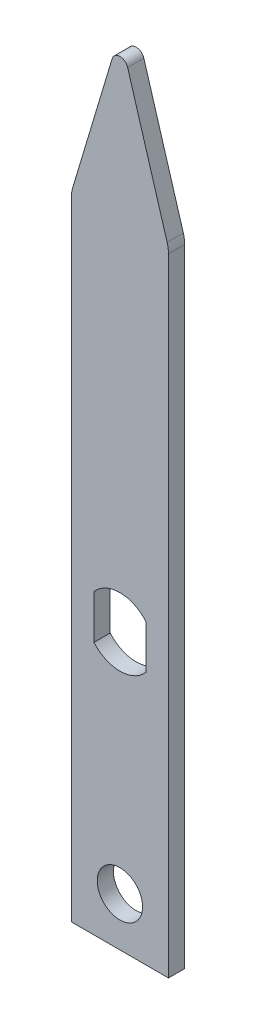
ISO-10303-21;
HEADER;
FILE_DESCRIPTION(('STEP AP214'),'2;1');
FILE_NAME('part.step','',(''),(''),'','','');
FILE_SCHEMA(('AUTOMOTIVE_DESIGN { 1 0 10303 214 1 1 1 1 }'));
ENDSEC;
DATA;
#1=APPLICATION_CONTEXT('core data for automotive mechanical design processes');
#2=APPLICATION_PROTOCOL_DEFINITION('international standard','automotive_design',2000,#1);
#3=PRODUCT_CONTEXT('',#1,'mechanical');
#4=PRODUCT('Part','Part','',(#3));
#5=PRODUCT_RELATED_PRODUCT_CATEGORY('part','',(#4));
#6=PRODUCT_DEFINITION_FORMATION('','',#4);
#7=PRODUCT_DEFINITION_CONTEXT('part definition',#1,'design');
#8=PRODUCT_DEFINITION('design','',#6,#7);
#9=PRODUCT_DEFINITION_SHAPE('','',#8);
#10=(LENGTH_UNIT() NAMED_UNIT(*) SI_UNIT(.MILLI.,.METRE.));
#11=(NAMED_UNIT(*) PLANE_ANGLE_UNIT() SI_UNIT($,.RADIAN.));
#12=(NAMED_UNIT(*) SI_UNIT($,.STERADIAN.) SOLID_ANGLE_UNIT());
#13=UNCERTAINTY_MEASURE_WITH_UNIT(LENGTH_MEASURE(1.E-05),#10,'distance_accuracy_value','');
#14=(GEOMETRIC_REPRESENTATION_CONTEXT(3) GLOBAL_UNCERTAINTY_ASSIGNED_CONTEXT((#13)) GLOBAL_UNIT_ASSIGNED_CONTEXT((#10,
#11,#12)) REPRESENTATION_CONTEXT('',''));
#15=CARTESIAN_POINT('',(0.,0.,0.));
#16=DIRECTION('',(0.,0.,1.));
#17=DIRECTION('',(1.,0.,0.));
#18=AXIS2_PLACEMENT_3D('',#15,#16,#17);
#19=CARTESIAN_POINT('',(15.,0.,5.));
#20=DIRECTION('',(0.,1.,0.));
#21=DIRECTION('',(-1.,0.,0.));
#22=AXIS2_PLACEMENT_3D('',#19,#20,#21);
#23=PLANE('',#22);
#24=DIRECTION('',(1.,0.,0.));
#25=VECTOR('',#24,1.);
#26=CARTESIAN_POINT('',(15.,0.,0.));
#27=LINE('',#26,#25);
#28=CARTESIAN_POINT('',(-15.,0.,0.));
#29=VERTEX_POINT('',#28);
#30=CARTESIAN_POINT('',(15.,0.,0.));
#31=VERTEX_POINT('',#30);
#32=EDGE_CURVE('E167',#29,#31,#27,.T.);
#33=ORIENTED_EDGE('',*,*,#32,.T.);
#34=DIRECTION('',(0.,0.,-1.));
#35=VECTOR('',#34,1.);
#36=CARTESIAN_POINT('',(15.,0.,5.));
#37=LINE('',#36,#35);
#38=CARTESIAN_POINT('',(15.,0.,5.));
#39=VERTEX_POINT('',#38);
#40=EDGE_CURVE('E196',#39,#31,#37,.T.);
#41=ORIENTED_EDGE('',*,*,#40,.F.);
#42=DIRECTION('',(1.,0.,0.));
#43=VECTOR('',#42,1.);
#44=CARTESIAN_POINT('',(15.,0.,5.));
#45=LINE('',#44,#43);
#46=CARTESIAN_POINT('',(-15.,0.,5.));
#47=VERTEX_POINT('',#46);
#48=EDGE_CURVE('E170',#47,#39,#45,.T.);
#49=ORIENTED_EDGE('',*,*,#48,.F.);
#50=DIRECTION('',(0.,0.,-1.));
#51=VECTOR('',#50,1.);
#52=CARTESIAN_POINT('',(-15.,0.,5.));
#53=LINE('',#52,#51);
#54=EDGE_CURVE('E183',#47,#29,#53,.T.);
#55=ORIENTED_EDGE('',*,*,#54,.T.);
#56=EDGE_LOOP('',(#33,#41,#49,#55));
#57=FACE_BOUND('',#56,.T.);
#58=ADVANCED_FACE('F32',(#57),#23,.F.);
#59=CARTESIAN_POINT('',(15.,195.,5.));
#60=DIRECTION('',(-1.,0.,0.));
#61=DIRECTION('',(0.,-1.,0.));
#62=AXIS2_PLACEMENT_3D('',#59,#60,#61);
#63=PLANE('',#62);
#64=DIRECTION('',(0.,1.,0.));
#65=VECTOR('',#64,1.);
#66=CARTESIAN_POINT('',(15.,195.,0.));
#67=LINE('',#66,#65);
#68=CARTESIAN_POINT('',(15.,193.532311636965,0.));
#69=VERTEX_POINT('',#68);
#70=EDGE_CURVE('E186',#31,#69,#67,.T.);
#71=ORIENTED_EDGE('',*,*,#70,.T.);
#72=DIRECTION('',(0.,0.,-1.));
#73=VECTOR('',#72,1.);
#74=CARTESIAN_POINT('',(15.,193.532311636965,5.));
#75=LINE('',#74,#73);
#76=CARTESIAN_POINT('',(15.,193.532311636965,5.));
#77=VERTEX_POINT('',#76);
#78=EDGE_CURVE('E217',#69,#77,#75,.F.);
#79=ORIENTED_EDGE('',*,*,#78,.T.);
#80=DIRECTION('',(0.,1.,0.));
#81=VECTOR('',#80,1.);
#82=CARTESIAN_POINT('',(15.,195.,5.));
#83=LINE('',#82,#81);
#84=EDGE_CURVE('E173',#39,#77,#83,.T.);
#85=ORIENTED_EDGE('',*,*,#84,.F.);
#86=ORIENTED_EDGE('',*,*,#40,.T.);
#87=EDGE_LOOP('',(#71,#79,#85,#86));
#88=FACE_BOUND('',#87,.T.);
#89=ADVANCED_FACE('F256',(#88),#63,.F.);
#90=CARTESIAN_POINT('',(0.,245.,5.));
#91=DIRECTION('',(-0.957826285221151,-0.287347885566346,0.));
#92=DIRECTION('',(0.287347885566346,-0.957826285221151,0.));
#93=AXIS2_PLACEMENT_3D('',#90,#91,#92);
#94=PLANE('',#93);
#95=DIRECTION('',(-0.287347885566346,0.957826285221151,0.));
#96=VECTOR('',#95,1.);
#97=CARTESIAN_POINT('',(0.,245.,5.));
#98=LINE('',#97,#96);
#99=CARTESIAN_POINT('',(14.5782628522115,196.405790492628,5.));
#100=VERTEX_POINT('',#99);
#101=CARTESIAN_POINT('',(2.39456571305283,237.018114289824,5.));
#102=VERTEX_POINT('',#101);
#103=EDGE_CURVE('E177',#100,#102,#98,.T.);
#104=ORIENTED_EDGE('',*,*,#103,.F.);
#105=DIRECTION('',(0.,0.,-1.));
#106=VECTOR('',#105,1.);
#107=CARTESIAN_POINT('',(14.5782628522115,196.405790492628,5.));
#108=LINE('',#107,#106);
#109=CARTESIAN_POINT('',(14.5782628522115,196.405790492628,0.));
#110=VERTEX_POINT('',#109);
#111=EDGE_CURVE('E210',#100,#110,#108,.T.);
#112=ORIENTED_EDGE('',*,*,#111,.T.);
#113=DIRECTION('',(-0.287347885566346,0.957826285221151,0.));
#114=VECTOR('',#113,1.);
#115=CARTESIAN_POINT('',(0.,245.,0.));
#116=LINE('',#115,#114);
#117=CARTESIAN_POINT('',(2.39456571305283,237.018114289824,0.));
#118=VERTEX_POINT('',#117);
#119=EDGE_CURVE('E189',#110,#118,#116,.T.);
#120=ORIENTED_EDGE('',*,*,#119,.T.);
#121=DIRECTION('',(0.,0.,-1.));
#122=VECTOR('',#121,1.);
#123=CARTESIAN_POINT('',(2.39456571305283,237.018114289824,5.));
#124=LINE('',#123,#122);
#125=EDGE_CURVE('E205',#118,#102,#124,.F.);
#126=ORIENTED_EDGE('',*,*,#125,.T.);
#127=EDGE_LOOP('',(#104,#112,#120,#126));
#128=FACE_BOUND('',#127,.T.);
#129=ADVANCED_FACE('F244',(#128),#94,.F.);
#130=CARTESIAN_POINT('',(-15.0000000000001,195.,5.));
#131=DIRECTION('',(0.957826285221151,-0.287347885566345,0.));
#132=DIRECTION('',(0.287347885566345,0.957826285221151,0.));
#133=AXIS2_PLACEMENT_3D('',#130,#131,#132);
#134=PLANE('',#133);
#135=DIRECTION('',(-0.287347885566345,-0.957826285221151,0.));
#136=VECTOR('',#135,1.);
#137=CARTESIAN_POINT('',(-15.0000000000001,195.,0.));
#138=LINE('',#137,#136);
#139=CARTESIAN_POINT('',(-2.39456571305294,237.018114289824,0.));
#140=VERTEX_POINT('',#139);
#141=CARTESIAN_POINT('',(-14.5782628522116,196.405790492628,0.));
#142=VERTEX_POINT('',#141);
#143=EDGE_CURVE('E191',#140,#142,#138,.T.);
#144=ORIENTED_EDGE('',*,*,#143,.T.);
#145=DIRECTION('',(0.,0.,-1.));
#146=VECTOR('',#145,1.);
#147=CARTESIAN_POINT('',(-14.5782628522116,196.405790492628,5.));
#148=LINE('',#147,#146);
#149=CARTESIAN_POINT('',(-14.5782628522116,196.405790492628,5.));
#150=VERTEX_POINT('',#149);
#151=EDGE_CURVE('E11',#142,#150,#148,.F.);
#152=ORIENTED_EDGE('',*,*,#151,.T.);
#153=DIRECTION('',(-0.287347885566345,-0.957826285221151,0.));
#154=VECTOR('',#153,1.);
#155=CARTESIAN_POINT('',(-15.0000000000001,195.,5.));
#156=LINE('',#155,#154);
#157=CARTESIAN_POINT('',(-2.39456571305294,237.018114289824,5.));
#158=VERTEX_POINT('',#157);
#159=EDGE_CURVE('E179',#158,#150,#156,.T.);
#160=ORIENTED_EDGE('',*,*,#159,.F.);
#161=DIRECTION('',(0.,0.,-1.));
#162=VECTOR('',#161,1.);
#163=CARTESIAN_POINT('',(-2.39456571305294,237.018114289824,5.));
#164=LINE('',#163,#162);
#165=EDGE_CURVE('E199',#158,#140,#164,.T.);
#166=ORIENTED_EDGE('',*,*,#165,.T.);
#167=EDGE_LOOP('',(#144,#152,#160,#166));
#168=FACE_BOUND('',#167,.T.);
#169=ADVANCED_FACE('F250',(#168),#134,.F.);
#170=CARTESIAN_POINT('',(-15.,0.,5.));
#171=DIRECTION('',(1.,0.,0.));
#172=DIRECTION('',(0.,1.,0.));
#173=AXIS2_PLACEMENT_3D('',#170,#171,#172);
#174=PLANE('',#173);
#175=DIRECTION('',(0.,-1.,0.));
#176=VECTOR('',#175,1.);
#177=CARTESIAN_POINT('',(-15.,0.,5.));
#178=LINE('',#177,#176);
#179=CARTESIAN_POINT('',(-15.0000000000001,193.532311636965,5.));
#180=VERTEX_POINT('',#179);
#181=EDGE_CURVE('E181',#180,#47,#178,.T.);
#182=ORIENTED_EDGE('',*,*,#181,.F.);
#183=DIRECTION('',(0.,0.,-1.));
#184=VECTOR('',#183,1.);
#185=CARTESIAN_POINT('',(-15.0000000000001,193.532311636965,5.));
#186=LINE('',#185,#184);
#187=CARTESIAN_POINT('',(-15.0000000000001,193.532311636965,0.));
#188=VERTEX_POINT('',#187);
#189=EDGE_CURVE('E40',#180,#188,#186,.T.);
#190=ORIENTED_EDGE('',*,*,#189,.T.);
#191=DIRECTION('',(0.,-1.,0.));
#192=VECTOR('',#191,1.);
#193=CARTESIAN_POINT('',(-15.,0.,0.));
#194=LINE('',#193,#192);
#195=EDGE_CURVE('E174',#188,#29,#194,.T.);
#196=ORIENTED_EDGE('',*,*,#195,.T.);
#197=ORIENTED_EDGE('',*,*,#54,.F.);
#198=EDGE_LOOP('',(#182,#190,#196,#197));
#199=FACE_BOUND('',#198,.T.);
#200=ADVANCED_FACE('F225',(#199),#174,.F.);
#201=CARTESIAN_POINT('',(-15.,0.,5.));
#202=DIRECTION('',(0.,0.,-1.));
#203=DIRECTION('',(-1.,0.,0.));
#204=AXIS2_PLACEMENT_3D('',#201,#202,#203);
#205=PLANE('',#204);
#206=DIRECTION('',(0.,1.,0.));
#207=VECTOR('',#206,1.);
#208=CARTESIAN_POINT('',(8.,91.8007352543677,5.));
#209=LINE('',#208,#207);
#210=CARTESIAN_POINT('',(8.,78.1992647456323,5.));
#211=VERTEX_POINT('',#210);
#212=CARTESIAN_POINT('',(8.,91.8007352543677,5.));
#213=VERTEX_POINT('',#212);
#214=EDGE_CURVE('E148',#211,#213,#209,.T.);
#215=ORIENTED_EDGE('',*,*,#214,.F.);
#216=CARTESIAN_POINT('',(0.,85.,5.));
#217=DIRECTION('',(0.,0.,1.));
#218=DIRECTION('',(1.,0.,0.));
#219=AXIS2_PLACEMENT_3D('',#216,#217,#218);
#220=CIRCLE('',#219,10.5);
#221=CARTESIAN_POINT('',(-8.,78.1992647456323,5.));
#222=VERTEX_POINT('',#221);
#223=EDGE_CURVE('E140',#222,#211,#220,.T.);
#224=ORIENTED_EDGE('',*,*,#223,.F.);
#225=DIRECTION('',(0.,-1.,0.));
#226=VECTOR('',#225,1.);
#227=CARTESIAN_POINT('',(-8.,91.8007352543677,5.));
#228=LINE('',#227,#226);
#229=CARTESIAN_POINT('',(-8.,91.8007352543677,5.));
#230=VERTEX_POINT('',#229);
#231=EDGE_CURVE('E141',#230,#222,#228,.T.);
#232=ORIENTED_EDGE('',*,*,#231,.F.);
#233=CARTESIAN_POINT('',(0.,85.,5.));
#234=DIRECTION('',(0.,0.,1.));
#235=DIRECTION('',(1.,0.,0.));
#236=AXIS2_PLACEMENT_3D('',#233,#234,#235);
#237=CIRCLE('',#236,10.5);
#238=EDGE_CURVE('E155',#213,#230,#237,.T.);
#239=ORIENTED_EDGE('',*,*,#238,.F.);
#240=EDGE_LOOP('',(#215,#224,#232,#239));
#241=FACE_BOUND('',#240,.T.);
#242=CARTESIAN_POINT('',(0.,15.,5.));
#243=DIRECTION('',(0.,0.,1.));
#244=DIRECTION('',(1.,0.,0.));
#245=AXIS2_PLACEMENT_3D('',#242,#243,#244);
#246=CIRCLE('',#245,7.);
#247=CARTESIAN_POINT('',(7.,15.,5.));
#248=VERTEX_POINT('',#247);
#249=EDGE_CURVE('E164',#248,#248,#246,.T.);
#250=ORIENTED_EDGE('',*,*,#249,.F.);
#251=EDGE_LOOP('',(#250));
#252=FACE_BOUND('',#251,.T.);
#253=ORIENTED_EDGE('',*,*,#84,.T.);
#254=CARTESIAN_POINT('',(4.99999999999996,193.532311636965,5.));
#255=DIRECTION('',(0.,0.,-1.));
#256=DIRECTION('',(-1.,0.,0.));
#257=AXIS2_PLACEMENT_3D('',#254,#255,#256);
#258=CIRCLE('',#257,10.);
#259=EDGE_CURVE('E220',#77,#100,#258,.F.);
#260=ORIENTED_EDGE('',*,*,#259,.T.);
#261=ORIENTED_EDGE('',*,*,#103,.T.);
#262=CARTESIAN_POINT('',(0.,236.299744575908,5.));
#263=DIRECTION('',(0.,0.,-1.));
#264=DIRECTION('',(-1.,0.,0.));
#265=AXIS2_PLACEMENT_3D('',#262,#263,#264);
#266=CIRCLE('',#265,2.5);
#267=EDGE_CURVE('E208',#102,#158,#266,.F.);
#268=ORIENTED_EDGE('',*,*,#267,.T.);
#269=ORIENTED_EDGE('',*,*,#159,.T.);
#270=CARTESIAN_POINT('',(-5.00000000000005,193.532311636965,5.));
#271=DIRECTION('',(0.,0.,-1.));
#272=DIRECTION('',(-1.,0.,0.));
#273=AXIS2_PLACEMENT_3D('',#270,#271,#272);
#274=CIRCLE('',#273,10.);
#275=EDGE_CURVE('E47',#150,#180,#274,.F.);
#276=ORIENTED_EDGE('',*,*,#275,.T.);
#277=ORIENTED_EDGE('',*,*,#181,.T.);
#278=ORIENTED_EDGE('',*,*,#48,.T.);
#279=EDGE_LOOP('',(#253,#260,#261,#268,#269,#276,#277,#278));
#280=FACE_BOUND('',#279,.T.);
#281=ADVANCED_FACE('F235',(#241,#252,#280),#205,.F.);
#282=CARTESIAN_POINT('',(-15.,0.,0.));
#283=DIRECTION('',(0.,0.,-1.));
#284=DIRECTION('',(-1.,0.,0.));
#285=AXIS2_PLACEMENT_3D('',#282,#283,#284);
#286=PLANE('',#285);
#287=CARTESIAN_POINT('',(0.,85.,0.));
#288=DIRECTION('',(0.,0.,-1.));
#289=DIRECTION('',(-1.,0.,0.));
#290=AXIS2_PLACEMENT_3D('',#287,#288,#289);
#291=CIRCLE('',#290,10.5);
#292=CARTESIAN_POINT('',(-8.,78.1992647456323,0.));
#293=VERTEX_POINT('',#292);
#294=CARTESIAN_POINT('',(8.,78.1992647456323,0.));
#295=VERTEX_POINT('',#294);
#296=EDGE_CURVE('E137',#293,#295,#291,.F.);
#297=ORIENTED_EDGE('',*,*,#296,.T.);
#298=DIRECTION('',(0.,1.,0.));
#299=VECTOR('',#298,1.);
#300=CARTESIAN_POINT('',(8.,91.8007352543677,0.));
#301=LINE('',#300,#299);
#302=CARTESIAN_POINT('',(8.,91.8007352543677,0.));
#303=VERTEX_POINT('',#302);
#304=EDGE_CURVE('E121',#295,#303,#301,.T.);
#305=ORIENTED_EDGE('',*,*,#304,.T.);
#306=CARTESIAN_POINT('',(0.,85.,0.));
#307=DIRECTION('',(0.,0.,-1.));
#308=DIRECTION('',(-1.,0.,0.));
#309=AXIS2_PLACEMENT_3D('',#306,#307,#308);
#310=CIRCLE('',#309,10.5);
#311=CARTESIAN_POINT('',(-8.,91.8007352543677,0.));
#312=VERTEX_POINT('',#311);
#313=EDGE_CURVE('E150',#303,#312,#310,.F.);
#314=ORIENTED_EDGE('',*,*,#313,.T.);
#315=DIRECTION('',(0.,-1.,0.));
#316=VECTOR('',#315,1.);
#317=CARTESIAN_POINT('',(-8.,91.8007352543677,0.));
#318=LINE('',#317,#316);
#319=EDGE_CURVE('E146',#312,#293,#318,.T.);
#320=ORIENTED_EDGE('',*,*,#319,.T.);
#321=EDGE_LOOP('',(#297,#305,#314,#320));
#322=FACE_BOUND('',#321,.T.);
#323=CARTESIAN_POINT('',(0.,15.,0.));
#324=DIRECTION('',(0.,0.,-1.));
#325=DIRECTION('',(-1.,0.,0.));
#326=AXIS2_PLACEMENT_3D('',#323,#324,#325);
#327=CIRCLE('',#326,7.);
#328=CARTESIAN_POINT('',(-7.,15.,0.));
#329=VERTEX_POINT('',#328);
#330=EDGE_CURVE('E132',#329,#329,#327,.F.);
#331=ORIENTED_EDGE('',*,*,#330,.T.);
#332=EDGE_LOOP('',(#331));
#333=FACE_BOUND('',#332,.T.);
#334=ORIENTED_EDGE('',*,*,#119,.F.);
#335=CARTESIAN_POINT('',(4.99999999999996,193.532311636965,0.));
#336=DIRECTION('',(0.,0.,-1.));
#337=DIRECTION('',(-1.,0.,0.));
#338=AXIS2_PLACEMENT_3D('',#335,#336,#337);
#339=CIRCLE('',#338,10.);
#340=EDGE_CURVE('E215',#110,#69,#339,.T.);
#341=ORIENTED_EDGE('',*,*,#340,.T.);
#342=ORIENTED_EDGE('',*,*,#70,.F.);
#343=ORIENTED_EDGE('',*,*,#32,.F.);
#344=ORIENTED_EDGE('',*,*,#195,.F.);
#345=CARTESIAN_POINT('',(-5.00000000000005,193.532311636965,0.));
#346=DIRECTION('',(0.,0.,-1.));
#347=DIRECTION('',(-1.,0.,0.));
#348=AXIS2_PLACEMENT_3D('',#345,#346,#347);
#349=CIRCLE('',#348,10.);
#350=EDGE_CURVE('E213',#188,#142,#349,.T.);
#351=ORIENTED_EDGE('',*,*,#350,.T.);
#352=ORIENTED_EDGE('',*,*,#143,.F.);
#353=CARTESIAN_POINT('',(0.,236.299744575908,0.));
#354=DIRECTION('',(0.,0.,-1.));
#355=DIRECTION('',(-1.,0.,0.));
#356=AXIS2_PLACEMENT_3D('',#353,#354,#355);
#357=CIRCLE('',#356,2.5);
#358=EDGE_CURVE('E202',#140,#118,#357,.T.);
#359=ORIENTED_EDGE('',*,*,#358,.T.);
#360=EDGE_LOOP('',(#334,#341,#342,#343,#344,#351,#352,#359));
#361=FACE_BOUND('',#360,.T.);
#362=ADVANCED_FACE('F144',(#322,#333,#361),#286,.T.);
#363=CARTESIAN_POINT('',(0.,15.,-0.00100000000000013));
#364=DIRECTION('',(0.,0.,1.));
#365=DIRECTION('',(1.,0.,0.));
#366=AXIS2_PLACEMENT_3D('',#363,#364,#365);
#367=CYLINDRICAL_SURFACE('',#366,7.);
#368=ORIENTED_EDGE('',*,*,#330,.F.);
#369=EDGE_LOOP('',(#368));
#370=FACE_BOUND('',#369,.T.);
#371=ORIENTED_EDGE('',*,*,#249,.T.);
#372=EDGE_LOOP('',(#371));
#373=FACE_BOUND('',#372,.T.);
#374=ADVANCED_FACE('F280',(#370,#373),#367,.F.);
#375=CARTESIAN_POINT('',(0.,85.,-0.00100000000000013));
#376=DIRECTION('',(0.,0.,1.));
#377=DIRECTION('',(1.,0.,0.));
#378=AXIS2_PLACEMENT_3D('',#375,#376,#377);
#379=CYLINDRICAL_SURFACE('',#378,10.5);
#380=DIRECTION('',(0.,0.,1.));
#381=VECTOR('',#380,1.);
#382=CARTESIAN_POINT('',(-8.,78.1992647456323,-0.00100000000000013));
#383=LINE('',#382,#381);
#384=EDGE_CURVE('E133',#293,#222,#383,.T.);
#385=ORIENTED_EDGE('',*,*,#384,.T.);
#386=ORIENTED_EDGE('',*,*,#223,.T.);
#387=DIRECTION('',(0.,0.,1.));
#388=VECTOR('',#387,1.);
#389=CARTESIAN_POINT('',(8.,78.1992647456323,-0.00100000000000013));
#390=LINE('',#389,#388);
#391=EDGE_CURVE('E125',#295,#211,#390,.T.);
#392=ORIENTED_EDGE('',*,*,#391,.F.);
#393=ORIENTED_EDGE('',*,*,#296,.F.);
#394=EDGE_LOOP('',(#385,#386,#392,#393));
#395=FACE_BOUND('',#394,.T.);
#396=ADVANCED_FACE('F136',(#395),#379,.F.);
#397=CARTESIAN_POINT('',(-8.,91.8007352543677,-0.00100000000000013));
#398=DIRECTION('',(-1.,0.,0.));
#399=DIRECTION('',(0.,0.,1.));
#400=AXIS2_PLACEMENT_3D('',#397,#398,#399);
#401=PLANE('',#400);
#402=DIRECTION('',(0.,0.,1.));
#403=VECTOR('',#402,1.);
#404=CARTESIAN_POINT('',(-8.,91.8007352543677,-0.00100000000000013));
#405=LINE('',#404,#403);
#406=EDGE_CURVE('E161',#312,#230,#405,.T.);
#407=ORIENTED_EDGE('',*,*,#406,.T.);
#408=ORIENTED_EDGE('',*,*,#231,.T.);
#409=ORIENTED_EDGE('',*,*,#384,.F.);
#410=ORIENTED_EDGE('',*,*,#319,.F.);
#411=EDGE_LOOP('',(#407,#408,#409,#410));
#412=FACE_BOUND('',#411,.T.);
#413=ADVANCED_FACE('F273',(#412),#401,.F.);
#414=CARTESIAN_POINT('',(0.,85.,-0.00100000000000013));
#415=DIRECTION('',(0.,0.,1.));
#416=DIRECTION('',(1.,0.,0.));
#417=AXIS2_PLACEMENT_3D('',#414,#415,#416);
#418=CYLINDRICAL_SURFACE('',#417,10.5);
#419=DIRECTION('',(0.,0.,1.));
#420=VECTOR('',#419,1.);
#421=CARTESIAN_POINT('',(8.,91.8007352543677,-0.00100000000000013));
#422=LINE('',#421,#420);
#423=EDGE_CURVE('E127',#303,#213,#422,.T.);
#424=ORIENTED_EDGE('',*,*,#423,.T.);
#425=ORIENTED_EDGE('',*,*,#238,.T.);
#426=ORIENTED_EDGE('',*,*,#406,.F.);
#427=ORIENTED_EDGE('',*,*,#313,.F.);
#428=EDGE_LOOP('',(#424,#425,#426,#427));
#429=FACE_BOUND('',#428,.T.);
#430=ADVANCED_FACE('F268',(#429),#418,.F.);
#431=CARTESIAN_POINT('',(8.,91.8007352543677,-0.00100000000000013));
#432=DIRECTION('',(1.,0.,0.));
#433=DIRECTION('',(0.,0.,-1.));
#434=AXIS2_PLACEMENT_3D('',#431,#432,#433);
#435=PLANE('',#434);
#436=ORIENTED_EDGE('',*,*,#391,.T.);
#437=ORIENTED_EDGE('',*,*,#214,.T.);
#438=ORIENTED_EDGE('',*,*,#423,.F.);
#439=ORIENTED_EDGE('',*,*,#304,.F.);
#440=EDGE_LOOP('',(#436,#437,#438,#439));
#441=FACE_BOUND('',#440,.T.);
#442=ADVANCED_FACE('F123',(#441),#435,.F.);
#443=CARTESIAN_POINT('',(0.,236.299744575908,5.));
#444=DIRECTION('',(0.,0.,-1.));
#445=DIRECTION('',(-1.,0.,0.));
#446=AXIS2_PLACEMENT_3D('',#443,#444,#445);
#447=CYLINDRICAL_SURFACE('',#446,2.5);
#448=ORIENTED_EDGE('',*,*,#267,.F.);
#449=ORIENTED_EDGE('',*,*,#125,.F.);
#450=ORIENTED_EDGE('',*,*,#358,.F.);
#451=ORIENTED_EDGE('',*,*,#165,.F.);
#452=EDGE_LOOP('',(#448,#449,#450,#451));
#453=FACE_BOUND('',#452,.T.);
#454=ADVANCED_FACE('F249',(#453),#447,.T.);
#455=CARTESIAN_POINT('',(4.99999999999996,193.532311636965,5.));
#456=DIRECTION('',(0.,0.,-1.));
#457=DIRECTION('',(-1.,0.,0.));
#458=AXIS2_PLACEMENT_3D('',#455,#456,#457);
#459=CYLINDRICAL_SURFACE('',#458,10.);
#460=ORIENTED_EDGE('',*,*,#259,.F.);
#461=ORIENTED_EDGE('',*,*,#78,.F.);
#462=ORIENTED_EDGE('',*,*,#340,.F.);
#463=ORIENTED_EDGE('',*,*,#111,.F.);
#464=EDGE_LOOP('',(#460,#461,#462,#463));
#465=FACE_BOUND('',#464,.T.);
#466=ADVANCED_FACE('F242',(#465),#459,.T.);
#467=CARTESIAN_POINT('',(-5.00000000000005,193.532311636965,5.));
#468=DIRECTION('',(0.,0.,-1.));
#469=DIRECTION('',(-1.,0.,0.));
#470=AXIS2_PLACEMENT_3D('',#467,#468,#469);
#471=CYLINDRICAL_SURFACE('',#470,10.);
#472=ORIENTED_EDGE('',*,*,#275,.F.);
#473=ORIENTED_EDGE('',*,*,#151,.F.);
#474=ORIENTED_EDGE('',*,*,#350,.F.);
#475=ORIENTED_EDGE('',*,*,#189,.F.);
#476=EDGE_LOOP('',(#472,#473,#474,#475));
#477=FACE_BOUND('',#476,.T.);
#478=ADVANCED_FACE('F34',(#477),#471,.T.);
#479=CLOSED_SHELL('',(#58,#89,#129,#169,#200,#281,#362,#374,#396,#413,#430,#442,#454,#466,#478));
#480=MANIFOLD_SOLID_BREP('B2',#479);
#481=ADVANCED_BREP_SHAPE_REPRESENTATION('',(#18,#480),#14);
#482=SHAPE_DEFINITION_REPRESENTATION(#9,#481);
ENDSEC;
END-ISO-10303-21;
